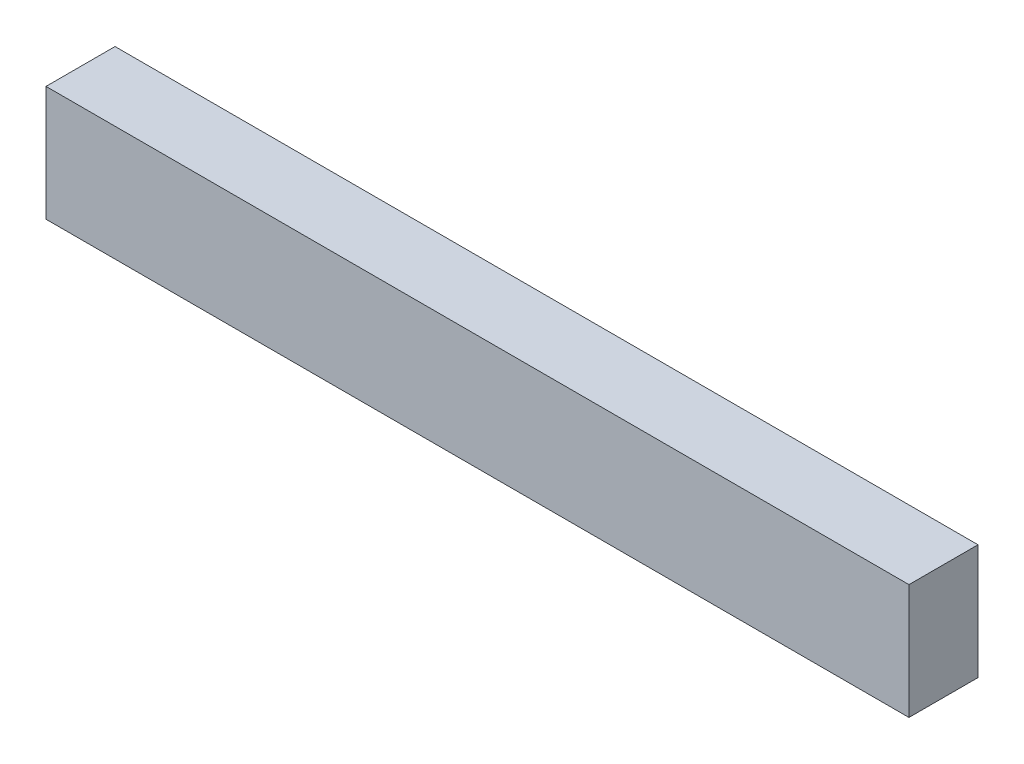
ISO-10303-21;
HEADER;
FILE_DESCRIPTION(('STEP AP214'),'2;1');
FILE_NAME('part.step','',(''),(''),'','','');
FILE_SCHEMA(('AUTOMOTIVE_DESIGN { 1 0 10303 214 1 1 1 1 }'));
ENDSEC;
DATA;
#1=APPLICATION_CONTEXT('core data for automotive mechanical design processes');
#2=APPLICATION_PROTOCOL_DEFINITION('international standard','automotive_design',2000,#1);
#3=PRODUCT_CONTEXT('',#1,'mechanical');
#4=PRODUCT('Part','Part','',(#3));
#5=PRODUCT_RELATED_PRODUCT_CATEGORY('part','',(#4));
#6=PRODUCT_DEFINITION_FORMATION('','',#4);
#7=PRODUCT_DEFINITION_CONTEXT('part definition',#1,'design');
#8=PRODUCT_DEFINITION('design','',#6,#7);
#9=PRODUCT_DEFINITION_SHAPE('','',#8);
#10=(LENGTH_UNIT() NAMED_UNIT(*) SI_UNIT(.MILLI.,.METRE.));
#11=(NAMED_UNIT(*) PLANE_ANGLE_UNIT() SI_UNIT($,.RADIAN.));
#12=(NAMED_UNIT(*) SI_UNIT($,.STERADIAN.) SOLID_ANGLE_UNIT());
#13=UNCERTAINTY_MEASURE_WITH_UNIT(LENGTH_MEASURE(1.E-05),#10,'distance_accuracy_value','');
#14=(GEOMETRIC_REPRESENTATION_CONTEXT(3) GLOBAL_UNCERTAINTY_ASSIGNED_CONTEXT((#13)) GLOBAL_UNIT_ASSIGNED_CONTEXT((#10,
#11,#12)) REPRESENTATION_CONTEXT('',''));
#15=CARTESIAN_POINT('',(0.,0.,0.));
#16=DIRECTION('',(0.,0.,1.));
#17=DIRECTION('',(1.,0.,0.));
#18=AXIS2_PLACEMENT_3D('',#15,#16,#17);
#19=CARTESIAN_POINT('',(0.,70.,0.));
#20=DIRECTION('',(1.,0.,0.));
#21=DIRECTION('',(0.,0.,-1.));
#22=AXIS2_PLACEMENT_3D('',#19,#20,#21);
#23=PLANE('',#22);
#24=DIRECTION('',(0.,0.,1.));
#25=VECTOR('',#24,1.);
#26=CARTESIAN_POINT('',(0.,0.,0.));
#27=LINE('',#26,#25);
#28=CARTESIAN_POINT('',(0.,0.,-42.));
#29=VERTEX_POINT('',#28);
#30=CARTESIAN_POINT('',(0.,0.,0.));
#31=VERTEX_POINT('',#30);
#32=EDGE_CURVE('E100',#29,#31,#27,.T.);
#33=ORIENTED_EDGE('',*,*,#32,.T.);
#34=DIRECTION('',(0.,-1.,0.));
#35=VECTOR('',#34,1.);
#36=CARTESIAN_POINT('',(0.,70.,0.));
#37=LINE('',#36,#35);
#38=CARTESIAN_POINT('',(0.,70.,0.));
#39=VERTEX_POINT('',#38);
#40=EDGE_CURVE('E11',#39,#31,#37,.T.);
#41=ORIENTED_EDGE('',*,*,#40,.F.);
#42=DIRECTION('',(0.,0.,1.));
#43=VECTOR('',#42,1.);
#44=CARTESIAN_POINT('',(0.,70.,0.));
#45=LINE('',#44,#43);
#46=CARTESIAN_POINT('',(0.,70.,-42.));
#47=VERTEX_POINT('',#46);
#48=EDGE_CURVE('E88',#47,#39,#45,.T.);
#49=ORIENTED_EDGE('',*,*,#48,.F.);
#50=DIRECTION('',(0.,-1.,0.));
#51=VECTOR('',#50,1.);
#52=CARTESIAN_POINT('',(0.,70.,-42.));
#53=LINE('',#52,#51);
#54=EDGE_CURVE('E96',#47,#29,#53,.T.);
#55=ORIENTED_EDGE('',*,*,#54,.T.);
#56=EDGE_LOOP('',(#33,#41,#49,#55));
#57=FACE_BOUND('',#56,.T.);
#58=ADVANCED_FACE('F37',(#57),#23,.F.);
#59=CARTESIAN_POINT('',(0.,70.,0.));
#60=DIRECTION('',(0.,0.,-1.));
#61=DIRECTION('',(-1.,0.,0.));
#62=AXIS2_PLACEMENT_3D('',#59,#60,#61);
#63=PLANE('',#62);
#64=DIRECTION('',(1.,0.,0.));
#65=VECTOR('',#64,1.);
#66=CARTESIAN_POINT('',(0.,0.,0.));
#67=LINE('',#66,#65);
#68=CARTESIAN_POINT('',(525.,0.,0.));
#69=VERTEX_POINT('',#68);
#70=EDGE_CURVE('E92',#31,#69,#67,.T.);
#71=ORIENTED_EDGE('',*,*,#70,.T.);
#72=DIRECTION('',(0.,-1.,0.));
#73=VECTOR('',#72,1.);
#74=CARTESIAN_POINT('',(525.,70.,0.));
#75=LINE('',#74,#73);
#76=CARTESIAN_POINT('',(525.,70.,0.));
#77=VERTEX_POINT('',#76);
#78=EDGE_CURVE('E45',#77,#69,#75,.T.);
#79=ORIENTED_EDGE('',*,*,#78,.F.);
#80=DIRECTION('',(1.,0.,0.));
#81=VECTOR('',#80,1.);
#82=CARTESIAN_POINT('',(0.,70.,0.));
#83=LINE('',#82,#81);
#84=EDGE_CURVE('E83',#39,#77,#83,.T.);
#85=ORIENTED_EDGE('',*,*,#84,.F.);
#86=ORIENTED_EDGE('',*,*,#40,.T.);
#87=EDGE_LOOP('',(#71,#79,#85,#86));
#88=FACE_BOUND('',#87,.T.);
#89=ADVANCED_FACE('F91',(#88),#63,.F.);
#90=CARTESIAN_POINT('',(525.,70.,0.));
#91=DIRECTION('',(-1.,0.,0.));
#92=DIRECTION('',(0.,0.,1.));
#93=AXIS2_PLACEMENT_3D('',#90,#91,#92);
#94=PLANE('',#93);
#95=DIRECTION('',(0.,0.,-1.));
#96=VECTOR('',#95,1.);
#97=CARTESIAN_POINT('',(525.,0.,0.));
#98=LINE('',#97,#96);
#99=CARTESIAN_POINT('',(525.,0.,-42.));
#100=VERTEX_POINT('',#99);
#101=EDGE_CURVE('E70',#69,#100,#98,.T.);
#102=ORIENTED_EDGE('',*,*,#101,.T.);
#103=DIRECTION('',(0.,-1.,0.));
#104=VECTOR('',#103,1.);
#105=CARTESIAN_POINT('',(525.,70.,-42.));
#106=LINE('',#105,#104);
#107=CARTESIAN_POINT('',(525.,70.,-42.));
#108=VERTEX_POINT('',#107);
#109=EDGE_CURVE('E93',#108,#100,#106,.T.);
#110=ORIENTED_EDGE('',*,*,#109,.F.);
#111=DIRECTION('',(0.,0.,-1.));
#112=VECTOR('',#111,1.);
#113=CARTESIAN_POINT('',(525.,70.,0.));
#114=LINE('',#113,#112);
#115=EDGE_CURVE('E86',#77,#108,#114,.T.);
#116=ORIENTED_EDGE('',*,*,#115,.F.);
#117=ORIENTED_EDGE('',*,*,#78,.T.);
#118=EDGE_LOOP('',(#102,#110,#116,#117));
#119=FACE_BOUND('',#118,.T.);
#120=ADVANCED_FACE('F94',(#119),#94,.F.);
#121=CARTESIAN_POINT('',(0.,70.,-42.));
#122=DIRECTION('',(0.,0.,1.));
#123=DIRECTION('',(1.,0.,0.));
#124=AXIS2_PLACEMENT_3D('',#121,#122,#123);
#125=PLANE('',#124);
#126=DIRECTION('',(-1.,0.,0.));
#127=VECTOR('',#126,1.);
#128=CARTESIAN_POINT('',(0.,0.,-42.));
#129=LINE('',#128,#127);
#130=EDGE_CURVE('E76',#100,#29,#129,.T.);
#131=ORIENTED_EDGE('',*,*,#130,.T.);
#132=ORIENTED_EDGE('',*,*,#54,.F.);
#133=DIRECTION('',(-1.,0.,0.));
#134=VECTOR('',#133,1.);
#135=CARTESIAN_POINT('',(0.,70.,-42.));
#136=LINE('',#135,#134);
#137=EDGE_CURVE('E53',#108,#47,#136,.T.);
#138=ORIENTED_EDGE('',*,*,#137,.F.);
#139=ORIENTED_EDGE('',*,*,#109,.T.);
#140=EDGE_LOOP('',(#131,#132,#138,#139));
#141=FACE_BOUND('',#140,.T.);
#142=ADVANCED_FACE('F107',(#141),#125,.F.);
#143=CARTESIAN_POINT('',(0.,70.,0.));
#144=DIRECTION('',(0.,-1.,0.));
#145=DIRECTION('',(0.,0.,-1.));
#146=AXIS2_PLACEMENT_3D('',#143,#144,#145);
#147=PLANE('',#146);
#148=ORIENTED_EDGE('',*,*,#48,.T.);
#149=ORIENTED_EDGE('',*,*,#84,.T.);
#150=ORIENTED_EDGE('',*,*,#115,.T.);
#151=ORIENTED_EDGE('',*,*,#137,.T.);
#152=EDGE_LOOP('',(#148,#149,#150,#151));
#153=FACE_BOUND('',#152,.T.);
#154=ADVANCED_FACE('F84',(#153),#147,.F.);
#155=CARTESIAN_POINT('',(0.,0.,0.));
#156=DIRECTION('',(0.,-1.,0.));
#157=DIRECTION('',(0.,0.,-1.));
#158=AXIS2_PLACEMENT_3D('',#155,#156,#157);
#159=PLANE('',#158);
#160=ORIENTED_EDGE('',*,*,#32,.F.);
#161=ORIENTED_EDGE('',*,*,#130,.F.);
#162=ORIENTED_EDGE('',*,*,#101,.F.);
#163=ORIENTED_EDGE('',*,*,#70,.F.);
#164=EDGE_LOOP('',(#160,#161,#162,#163));
#165=FACE_BOUND('',#164,.T.);
#166=ADVANCED_FACE('F110',(#165),#159,.T.);
#167=CLOSED_SHELL('',(#58,#89,#120,#142,#154,#166));
#168=MANIFOLD_SOLID_BREP('B2',#167);
#169=ADVANCED_BREP_SHAPE_REPRESENTATION('',(#18,#168),#14);
#170=SHAPE_DEFINITION_REPRESENTATION(#9,#169);
ENDSEC;
END-ISO-10303-21;
